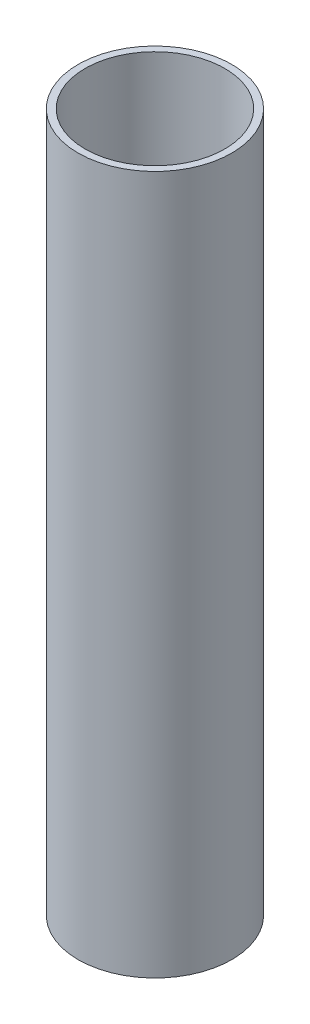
ISO-10303-21;
HEADER;
FILE_DESCRIPTION(('STEP AP214'),'2;1');
FILE_NAME('part.step','',(''),(''),'','','');
FILE_SCHEMA(('AUTOMOTIVE_DESIGN { 1 0 10303 214 1 1 1 1 }'));
ENDSEC;
DATA;
#1=APPLICATION_CONTEXT('core data for automotive mechanical design processes');
#2=APPLICATION_PROTOCOL_DEFINITION('international standard','automotive_design',2000,#1);
#3=PRODUCT_CONTEXT('',#1,'mechanical');
#4=PRODUCT('Part','Part','',(#3));
#5=PRODUCT_RELATED_PRODUCT_CATEGORY('part','',(#4));
#6=PRODUCT_DEFINITION_FORMATION('','',#4);
#7=PRODUCT_DEFINITION_CONTEXT('part definition',#1,'design');
#8=PRODUCT_DEFINITION('design','',#6,#7);
#9=PRODUCT_DEFINITION_SHAPE('','',#8);
#10=(LENGTH_UNIT() NAMED_UNIT(*) SI_UNIT(.MILLI.,.METRE.));
#11=(NAMED_UNIT(*) PLANE_ANGLE_UNIT() SI_UNIT($,.RADIAN.));
#12=(NAMED_UNIT(*) SI_UNIT($,.STERADIAN.) SOLID_ANGLE_UNIT());
#13=UNCERTAINTY_MEASURE_WITH_UNIT(LENGTH_MEASURE(1.E-05),#10,'distance_accuracy_value','');
#14=(GEOMETRIC_REPRESENTATION_CONTEXT(3) GLOBAL_UNCERTAINTY_ASSIGNED_CONTEXT((#13)) GLOBAL_UNIT_ASSIGNED_CONTEXT((#10,
#11,#12)) REPRESENTATION_CONTEXT('',''));
#15=CARTESIAN_POINT('',(0.,0.,0.));
#16=DIRECTION('',(0.,0.,1.));
#17=DIRECTION('',(1.,0.,0.));
#18=AXIS2_PLACEMENT_3D('',#15,#16,#17);
#19=CARTESIAN_POINT('',(0.,1000.,0.));
#20=DIRECTION('',(0.,-1.,0.));
#21=DIRECTION('',(0.,0.,-1.));
#22=AXIS2_PLACEMENT_3D('',#19,#20,#21);
#23=CYLINDRICAL_SURFACE('',#22,110.);
#24=CARTESIAN_POINT('',(0.,1000.,0.));
#25=DIRECTION('',(0.,1.,0.));
#26=DIRECTION('',(0.,0.,1.));
#27=AXIS2_PLACEMENT_3D('',#24,#25,#26);
#28=CIRCLE('',#27,110.);
#29=CARTESIAN_POINT('',(0.,1000.,110.));
#30=VERTEX_POINT('',#29);
#31=EDGE_CURVE('E10',#30,#30,#28,.T.);
#32=ORIENTED_EDGE('',*,*,#31,.F.);
#33=EDGE_LOOP('',(#32));
#34=FACE_BOUND('',#33,.T.);
#35=CARTESIAN_POINT('',(0.,0.,0.));
#36=DIRECTION('',(0.,1.,0.));
#37=DIRECTION('',(0.,0.,1.));
#38=AXIS2_PLACEMENT_3D('',#35,#36,#37);
#39=CIRCLE('',#38,110.);
#40=CARTESIAN_POINT('',(0.,0.,110.));
#41=VERTEX_POINT('',#40);
#42=EDGE_CURVE('E34',#41,#41,#39,.T.);
#43=ORIENTED_EDGE('',*,*,#42,.T.);
#44=EDGE_LOOP('',(#43));
#45=FACE_BOUND('',#44,.T.);
#46=ADVANCED_FACE('F31',(#34,#45),#23,.T.);
#47=CARTESIAN_POINT('',(0.,1000.,0.));
#48=DIRECTION('',(0.,1.,0.));
#49=DIRECTION('',(0.,0.,1.));
#50=AXIS2_PLACEMENT_3D('',#47,#48,#49);
#51=PLANE('',#50);
#52=CARTESIAN_POINT('',(0.,1000.,0.));
#53=DIRECTION('',(0.,1.,0.));
#54=DIRECTION('',(0.,0.,1.));
#55=AXIS2_PLACEMENT_3D('',#52,#53,#54);
#56=CIRCLE('',#55,100.);
#57=CARTESIAN_POINT('',(0.,1000.,100.));
#58=VERTEX_POINT('',#57);
#59=EDGE_CURVE('E41',#58,#58,#56,.T.);
#60=ORIENTED_EDGE('',*,*,#59,.F.);
#61=EDGE_LOOP('',(#60));
#62=FACE_BOUND('',#61,.T.);
#63=ORIENTED_EDGE('',*,*,#31,.T.);
#64=EDGE_LOOP('',(#63));
#65=FACE_BOUND('',#64,.T.);
#66=ADVANCED_FACE('F52',(#62,#65),#51,.T.);
#67=CARTESIAN_POINT('',(0.,0.,0.));
#68=DIRECTION('',(0.,1.,0.));
#69=DIRECTION('',(0.,0.,1.));
#70=AXIS2_PLACEMENT_3D('',#67,#68,#69);
#71=PLANE('',#70);
#72=CARTESIAN_POINT('',(0.,0.,0.));
#73=DIRECTION('',(0.,1.,0.));
#74=DIRECTION('',(0.,0.,1.));
#75=AXIS2_PLACEMENT_3D('',#72,#73,#74);
#76=CIRCLE('',#75,100.);
#77=CARTESIAN_POINT('',(0.,0.,100.));
#78=VERTEX_POINT('',#77);
#79=EDGE_CURVE('E43',#78,#78,#76,.T.);
#80=ORIENTED_EDGE('',*,*,#79,.T.);
#81=EDGE_LOOP('',(#80));
#82=FACE_BOUND('',#81,.T.);
#83=ORIENTED_EDGE('',*,*,#42,.F.);
#84=EDGE_LOOP('',(#83));
#85=FACE_BOUND('',#84,.T.);
#86=ADVANCED_FACE('F54',(#82,#85),#71,.F.);
#87=CARTESIAN_POINT('',(0.,1000.,0.));
#88=DIRECTION('',(0.,-1.,0.));
#89=DIRECTION('',(0.,0.,-1.));
#90=AXIS2_PLACEMENT_3D('',#87,#88,#89);
#91=CYLINDRICAL_SURFACE('',#90,100.);
#92=ORIENTED_EDGE('',*,*,#59,.T.);
#93=EDGE_LOOP('',(#92));
#94=FACE_BOUND('',#93,.T.);
#95=ORIENTED_EDGE('',*,*,#79,.F.);
#96=EDGE_LOOP('',(#95));
#97=FACE_BOUND('',#96,.T.);
#98=ADVANCED_FACE('F49',(#94,#97),#91,.F.);
#99=CLOSED_SHELL('',(#46,#66,#86,#98));
#100=MANIFOLD_SOLID_BREP('B2',#99);
#101=ADVANCED_BREP_SHAPE_REPRESENTATION('',(#18,#100),#14);
#102=SHAPE_DEFINITION_REPRESENTATION(#9,#101);
ENDSEC;
END-ISO-10303-21;
